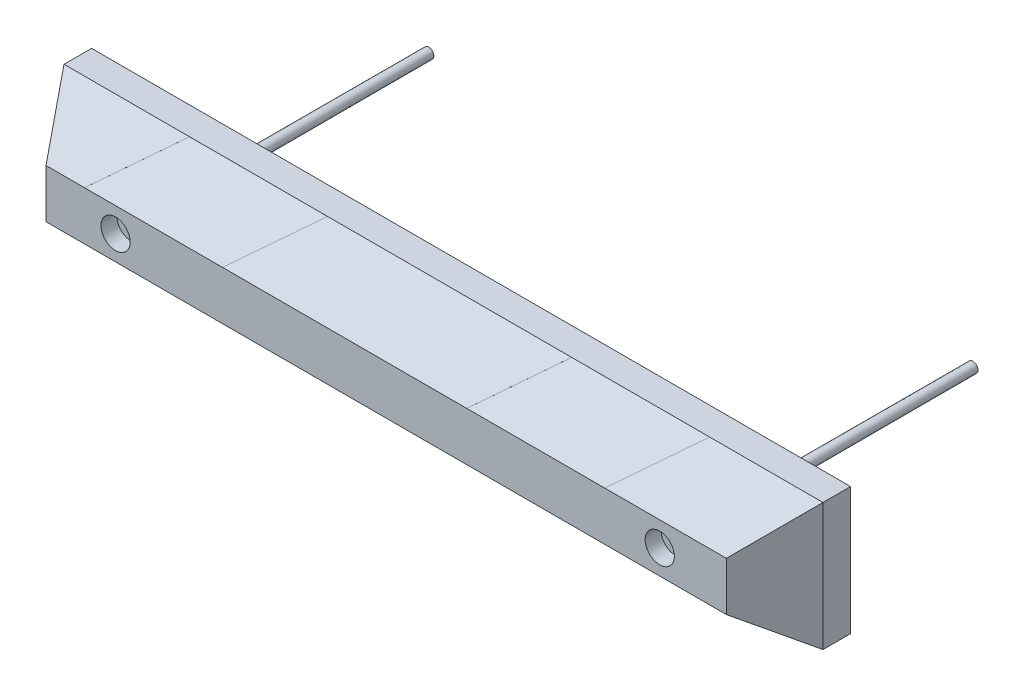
from build123d import *

# Parameters (mm, degrees)
SKETCH1_W                     = 908.05
SKETCH1_H                     = 152.4
BOSS_EXTRUDE1_DEPTH           = 33.02
SKETCH2_W                     = 908.05
SKETCH2_H                     = 152.4
BOSS_EXTRUDE2_DEPTH           = 68.58
BOSS_EXTRUDE2_TAPER           = 34.45
SKETCH3_R                     = 7.9375
CUT_EXTRUDE1_DEPTH            = 472.452755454
SKETCH4_R                     = 17.4625
CUT_EXTRUDE3_DEPTH            = 19.05
CUT_EXTRUDE4_DEPTH            = 0.0254
SKETCH6_R                     = 16.744896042
BOSS_EXTRUDE3_DEPTH           = 0.0254
SKETCH7_R                     = 6.35
BOSS_EXTRUDE4_DEPTH           = 273.05
BOSS_EXTRUDE4_DRAFT           = -0.05
BOSS_EXTRUDE4_PROFILE_2_DEPTH = 273.05
BOSS_EXTRUDE4_PROFILE_2_DRAFT = -0.05


with BuildPart() as part:
    # Sketch1 → Boss-Extrude1 (new body)
    with BuildSketch(Plane.XY):
        Rectangle(SKETCH1_W, SKETCH1_H)
    extrude(amount=BOSS_EXTRUDE1_DEPTH)

    # Sketch2 → Boss-Extrude2 (add)
    with BuildSketch(Plane.XY.offset(33.02)):
        Rectangle(SKETCH2_W, SKETCH2_H)
    extrude(amount=BOSS_EXTRUDE2_DEPTH, taper=BOSS_EXTRUDE2_TAPER)

    # Sketch3 → Cut-Extrude1 (cut, through all)
    with BuildSketch(Plane.XY.offset(101.6)):
        with Locations((-323.723, 0)):
            Circle(SKETCH3_R)
        with Locations((327.279, 0)):
            Circle(SKETCH3_R)
    extrude(amount=-CUT_EXTRUDE1_DEPTH, mode=Mode.SUBTRACT)

    # Sketch4 → Cut-Extrude3 (cut)
    with BuildSketch(Plane.XY.offset(101.6)):
        with Locations((-323.723, 0)):
            Circle(SKETCH4_R)
        with Locations((327.279, 0)):
            Circle(SKETCH4_R)
    extrude(amount=-CUT_EXTRUDE3_DEPTH, mode=Mode.SUBTRACT)

    # Sketch5 → Cut-Extrude4 (cut)
    with BuildSketch(Plane(origin=(0, -67.218941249, 46.111982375), x_dir=(1, 0, 0), z_dir=(0, -0.8246201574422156, 0.5656868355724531))):
        Polygon((-360.871385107, 67.289184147), (-195.771385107, 67.289184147), (-138.720070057, -15.876379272), (-303.820070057, -15.876379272), align=None)
        Polygon((96.328614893, 67.289184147), (153.379929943, -15.876379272), (318.479929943, -15.876379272), (261.428614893, 67.289184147), align=None)
    cut_extrude4 = extrude(amount=-CUT_EXTRUDE4_DEPTH, mode=Mode.SUBTRACT)

    # Mirror1: Cut-Extrude4 across plane
    add(cut_extrude4.mirror(Plane.ZX), mode=Mode.SUBTRACT)

    # Sketch6 → Boss-Extrude3 (add)
    with BuildSketch(Plane(origin=(0, 0, 0), x_dir=(-1, 0, 0), z_dir=(0, 0, -1))):
        with Locations(Location((323.723, 0, 0), (0, 0, 180))):
            Circle(SKETCH6_R)
        with Locations(Location((-327.279, 0, 0), (0, 0, 180))):
            Circle(SKETCH6_R)
    extrude(amount=BOSS_EXTRUDE3_DEPTH)


with BuildPart() as boss_extrude4_tool:
    # Sketch7 → Boss-Extrude4 (with draft: the straight prism first)
    with BuildSketch(Plane.XY):
        with Locations((327.279, 0)):
            Circle(SKETCH7_R)
    extrude(amount=-BOSS_EXTRUDE4_DEPTH)
    # Boss-Extrude4: the draft: its side faces are tilted about the plane it starts from
    boss_extrude4_sides = [boss_extrude4_tool.faces().sort_by_distance(p)[0] for p in [
        (320.929, 0, -136.525),
    ]]
    draft(boss_extrude4_sides, Plane.XY, BOSS_EXTRUDE4_DRAFT)


with BuildPart() as part_1:
    add(part.part)

    # Boss-Extrude4: add boss_extrude4_tool
    add(boss_extrude4_tool.part)


with BuildPart() as boss_extrude4_profile_2_tool:
    # Sketch7 → Boss-Extrude4 profile 2 (with draft: the straight prism first)
    with BuildSketch(Plane.XY):
        with Locations((-323.723, 0)):
            Circle(SKETCH7_R)
    extrude(amount=-BOSS_EXTRUDE4_PROFILE_2_DEPTH)
    # Boss-Extrude4 profile 2: the draft: its side faces are tilted about the plane it starts from
    boss_extrude4_profile_2_sides = [boss_extrude4_profile_2_tool.faces().sort_by_distance(p)[0] for p in [
        (-330.073, 0, -136.525),
    ]]
    draft(boss_extrude4_profile_2_sides, Plane.XY, BOSS_EXTRUDE4_PROFILE_2_DRAFT)


with BuildPart() as part_2:
    add(part_1.part)

    # Boss-Extrude4 profile 2: add boss_extrude4_profile_2_tool
    add(boss_extrude4_profile_2_tool.part)


solid = part_2.part
